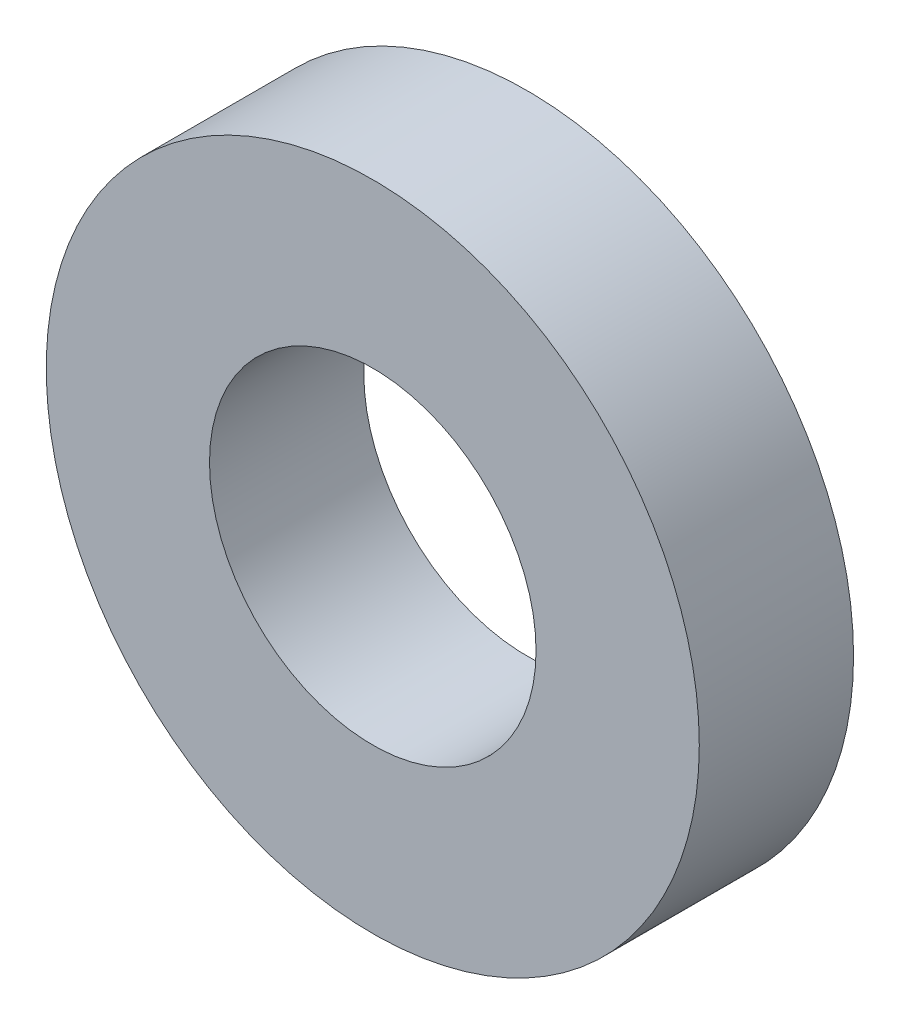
from build123d import *

# Parameters (mm, degrees)
SKETCH1_R           = 6.35
SKETCH1_R_2         = 3.175
BOSS_EXTRUDE1_DEPTH = 3


with BuildPart() as part:
    # Sketch1 → Boss-Extrude1 (new body)
    with BuildSketch(Plane.XY):
        Circle(SKETCH1_R)
        Circle(SKETCH1_R_2, mode=Mode.SUBTRACT)
    extrude(amount=BOSS_EXTRUDE1_DEPTH)


solid = part.part
